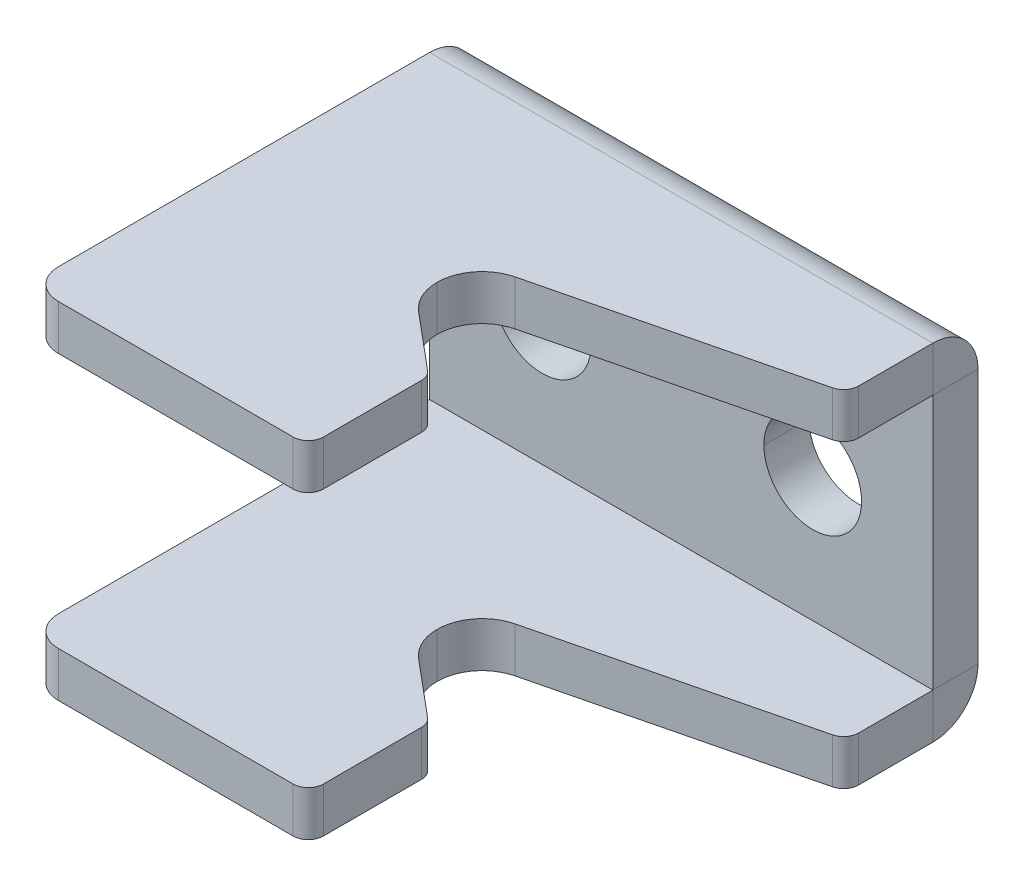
ISO-10303-21;
HEADER;
FILE_DESCRIPTION(('STEP AP214'),'2;1');
FILE_NAME('part.step','',(''),(''),'','','');
FILE_SCHEMA(('AUTOMOTIVE_DESIGN { 1 0 10303 214 1 1 1 1 }'));
ENDSEC;
DATA;
#1=APPLICATION_CONTEXT('core data for automotive mechanical design processes');
#2=APPLICATION_PROTOCOL_DEFINITION('international standard','automotive_design',2000,#1);
#3=PRODUCT_CONTEXT('',#1,'mechanical');
#4=PRODUCT('Part','Part','',(#3));
#5=PRODUCT_RELATED_PRODUCT_CATEGORY('part','',(#4));
#6=PRODUCT_DEFINITION_FORMATION('','',#4);
#7=PRODUCT_DEFINITION_CONTEXT('part definition',#1,'design');
#8=PRODUCT_DEFINITION('design','',#6,#7);
#9=PRODUCT_DEFINITION_SHAPE('','',#8);
#10=(LENGTH_UNIT() NAMED_UNIT(*) SI_UNIT(.MILLI.,.METRE.));
#11=(NAMED_UNIT(*) PLANE_ANGLE_UNIT() SI_UNIT($,.RADIAN.));
#12=(NAMED_UNIT(*) SI_UNIT($,.STERADIAN.) SOLID_ANGLE_UNIT());
#13=UNCERTAINTY_MEASURE_WITH_UNIT(LENGTH_MEASURE(1.E-05),#10,'distance_accuracy_value','');
#14=(GEOMETRIC_REPRESENTATION_CONTEXT(3) GLOBAL_UNCERTAINTY_ASSIGNED_CONTEXT((#13)) GLOBAL_UNIT_ASSIGNED_CONTEXT((#10,
#11,#12)) REPRESENTATION_CONTEXT('',''));
#15=CARTESIAN_POINT('',(0.,0.,0.));
#16=DIRECTION('',(0.,0.,1.));
#17=DIRECTION('',(1.,0.,0.));
#18=AXIS2_PLACEMENT_3D('',#15,#16,#17);
#19=CARTESIAN_POINT('',(0.,0.,3.));
#20=DIRECTION('',(0.,0.,1.));
#21=DIRECTION('',(1.,0.,0.));
#22=AXIS2_PLACEMENT_3D('',#19,#20,#21);
#23=CYLINDRICAL_SURFACE('',#22,3.25);
#24=CARTESIAN_POINT('',(0.,0.,0.));
#25=DIRECTION('',(0.,0.,1.));
#26=DIRECTION('',(1.,0.,0.));
#27=AXIS2_PLACEMENT_3D('',#24,#25,#26);
#28=CIRCLE('',#27,3.25);
#29=CARTESIAN_POINT('',(-3.25,0.,0.));
#30=VERTEX_POINT('',#29);
#31=CARTESIAN_POINT('',(3.25,0.,0.));
#32=VERTEX_POINT('',#31);
#33=EDGE_CURVE('E39',#30,#32,#28,.T.);
#34=ORIENTED_EDGE('',*,*,#33,.F.);
#35=DIRECTION('',(0.,0.,1.));
#36=VECTOR('',#35,1.);
#37=CARTESIAN_POINT('',(-3.25,0.,3.));
#38=LINE('',#37,#36);
#39=CARTESIAN_POINT('',(-3.25,0.,3.));
#40=VERTEX_POINT('',#39);
#41=EDGE_CURVE('E9',#30,#40,#38,.T.);
#42=ORIENTED_EDGE('',*,*,#41,.T.);
#43=CARTESIAN_POINT('',(0.,0.,3.));
#44=DIRECTION('',(0.,0.,1.));
#45=DIRECTION('',(1.,0.,0.));
#46=AXIS2_PLACEMENT_3D('',#43,#44,#45);
#47=CIRCLE('',#46,3.25);
#48=CARTESIAN_POINT('',(3.25,0.,3.));
#49=VERTEX_POINT('',#48);
#50=EDGE_CURVE('E25',#40,#49,#47,.T.);
#51=ORIENTED_EDGE('',*,*,#50,.T.);
#52=DIRECTION('',(0.,0.,1.));
#53=VECTOR('',#52,1.);
#54=CARTESIAN_POINT('',(3.25,0.,3.));
#55=LINE('',#54,#53);
#56=EDGE_CURVE('E356',#32,#49,#55,.T.);
#57=ORIENTED_EDGE('',*,*,#56,.F.);
#58=EDGE_LOOP('',(#34,#42,#51,#57));
#59=FACE_BOUND('',#58,.T.);
#60=ADVANCED_FACE('F14',(#59),#23,.F.);
#61=CARTESIAN_POINT('',(18.,0.,3.));
#62=DIRECTION('',(0.,0.,1.));
#63=DIRECTION('',(1.,0.,0.));
#64=AXIS2_PLACEMENT_3D('',#61,#62,#63);
#65=CYLINDRICAL_SURFACE('',#64,3.25);
#66=CARTESIAN_POINT('',(18.,0.,0.));
#67=DIRECTION('',(0.,0.,1.));
#68=DIRECTION('',(1.,0.,0.));
#69=AXIS2_PLACEMENT_3D('',#66,#67,#68);
#70=CIRCLE('',#69,3.25);
#71=CARTESIAN_POINT('',(14.75,0.,0.));
#72=VERTEX_POINT('',#71);
#73=CARTESIAN_POINT('',(21.25,0.,0.));
#74=VERTEX_POINT('',#73);
#75=EDGE_CURVE('E454',#72,#74,#70,.T.);
#76=ORIENTED_EDGE('',*,*,#75,.F.);
#77=DIRECTION('',(0.,0.,1.));
#78=VECTOR('',#77,1.);
#79=CARTESIAN_POINT('',(14.75,0.,3.));
#80=LINE('',#79,#78);
#81=CARTESIAN_POINT('',(14.75,0.,3.));
#82=VERTEX_POINT('',#81);
#83=EDGE_CURVE('E554',#72,#82,#80,.T.);
#84=ORIENTED_EDGE('',*,*,#83,.T.);
#85=CARTESIAN_POINT('',(18.,0.,3.));
#86=DIRECTION('',(0.,0.,1.));
#87=DIRECTION('',(1.,0.,0.));
#88=AXIS2_PLACEMENT_3D('',#85,#86,#87);
#89=CIRCLE('',#88,3.25);
#90=CARTESIAN_POINT('',(21.25,0.,3.));
#91=VERTEX_POINT('',#90);
#92=EDGE_CURVE('E641',#82,#91,#89,.T.);
#93=ORIENTED_EDGE('',*,*,#92,.T.);
#94=DIRECTION('',(0.,0.,1.));
#95=VECTOR('',#94,1.);
#96=CARTESIAN_POINT('',(21.25,0.,3.));
#97=LINE('',#96,#95);
#98=EDGE_CURVE('E348',#74,#91,#97,.T.);
#99=ORIENTED_EDGE('',*,*,#98,.F.);
#100=EDGE_LOOP('',(#76,#84,#93,#99));
#101=FACE_BOUND('',#100,.T.);
#102=ADVANCED_FACE('F783',(#101),#65,.F.);
#103=CARTESIAN_POINT('',(9.,8.49999999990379,15.9999999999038));
#104=DIRECTION('',(0.,1.,0.));
#105=DIRECTION('',(-1.,0.,0.));
#106=AXIS2_PLACEMENT_3D('',#103,#104,#105);
#107=CYLINDRICAL_SURFACE('',#106,3.);
#108=CARTESIAN_POINT('',(9.,8.49999999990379,15.9999999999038));
#109=DIRECTION('',(0.,1.,0.));
#110=DIRECTION('',(1.,0.,0.));
#111=AXIS2_PLACEMENT_3D('',#108,#109,#110);
#112=CIRCLE('',#111,3.);
#113=CARTESIAN_POINT('',(6.,8.49999999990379,15.9999999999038));
#114=VERTEX_POINT('',#113);
#115=CARTESIAN_POINT('',(7.07280249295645,8.49999999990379,18.2991106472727));
#116=VERTEX_POINT('',#115);
#117=EDGE_CURVE('E440',#114,#116,#112,.T.);
#118=ORIENTED_EDGE('',*,*,#117,.F.);
#119=DIRECTION('',(0.,1.,0.));
#120=VECTOR('',#119,1.);
#121=CARTESIAN_POINT('',(6.,8.49999999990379,15.9999999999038));
#122=LINE('',#121,#120);
#123=CARTESIAN_POINT('',(6.,11.4999999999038,15.9999999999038));
#124=VERTEX_POINT('',#123);
#125=EDGE_CURVE('E542',#114,#124,#122,.T.);
#126=ORIENTED_EDGE('',*,*,#125,.T.);
#127=CARTESIAN_POINT('',(9.,11.4999999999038,15.9999999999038));
#128=DIRECTION('',(0.,1.,0.));
#129=DIRECTION('',(1.,0.,0.));
#130=AXIS2_PLACEMENT_3D('',#127,#128,#129);
#131=CIRCLE('',#130,3.);
#132=CARTESIAN_POINT('',(7.0728024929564,11.4999999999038,18.2991106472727));
#133=VERTEX_POINT('',#132);
#134=EDGE_CURVE('E423',#124,#133,#131,.T.);
#135=ORIENTED_EDGE('',*,*,#134,.T.);
#136=DIRECTION('',(0.,1.,0.));
#137=VECTOR('',#136,1.);
#138=CARTESIAN_POINT('',(7.07280249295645,8.49999999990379,18.2991106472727));
#139=LINE('',#138,#137);
#140=EDGE_CURVE('E415',#116,#133,#139,.T.);
#141=ORIENTED_EDGE('',*,*,#140,.F.);
#142=EDGE_LOOP('',(#118,#126,#135,#141));
#143=FACE_BOUND('',#142,.T.);
#144=ADVANCED_FACE('F789',(#143),#107,.F.);
#145=CARTESIAN_POINT('',(9.,-8.49999999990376,15.9999999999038));
#146=DIRECTION('',(0.,-1.,0.));
#147=DIRECTION('',(-1.,0.,0.));
#148=AXIS2_PLACEMENT_3D('',#145,#146,#147);
#149=CYLINDRICAL_SURFACE('',#148,3.);
#150=CARTESIAN_POINT('',(9.,-8.49999999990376,15.9999999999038));
#151=DIRECTION('',(0.,-1.,0.));
#152=DIRECTION('',(1.,0.,0.));
#153=AXIS2_PLACEMENT_3D('',#150,#151,#152);
#154=CIRCLE('',#153,3.);
#155=CARTESIAN_POINT('',(6.,-8.49999999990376,15.9999999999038));
#156=VERTEX_POINT('',#155);
#157=CARTESIAN_POINT('',(8.2834036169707,-8.49999999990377,13.0868419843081));
#158=VERTEX_POINT('',#157);
#159=EDGE_CURVE('E366',#156,#158,#154,.T.);
#160=ORIENTED_EDGE('',*,*,#159,.F.);
#161=DIRECTION('',(0.,-1.,0.));
#162=VECTOR('',#161,1.);
#163=CARTESIAN_POINT('',(6.,-8.49999999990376,15.9999999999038));
#164=LINE('',#163,#162);
#165=CARTESIAN_POINT('',(6.,-11.4999999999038,15.9999999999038));
#166=VERTEX_POINT('',#165);
#167=EDGE_CURVE('E354',#156,#166,#164,.T.);
#168=ORIENTED_EDGE('',*,*,#167,.T.);
#169=CARTESIAN_POINT('',(9.,-11.4999999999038,15.9999999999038));
#170=DIRECTION('',(0.,-1.,0.));
#171=DIRECTION('',(1.,0.,0.));
#172=AXIS2_PLACEMENT_3D('',#169,#170,#171);
#173=CIRCLE('',#172,3.);
#174=CARTESIAN_POINT('',(8.2834036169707,-11.4999999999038,13.0868419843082));
#175=VERTEX_POINT('',#174);
#176=EDGE_CURVE('E350',#166,#175,#173,.T.);
#177=ORIENTED_EDGE('',*,*,#176,.T.);
#178=DIRECTION('',(0.,-1.,0.));
#179=VECTOR('',#178,1.);
#180=CARTESIAN_POINT('',(8.2834036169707,-8.49999999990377,13.0868419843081));
#181=LINE('',#180,#179);
#182=EDGE_CURVE('E391',#158,#175,#181,.T.);
#183=ORIENTED_EDGE('',*,*,#182,.F.);
#184=EDGE_LOOP('',(#160,#168,#177,#183));
#185=FACE_BOUND('',#184,.T.);
#186=ADVANCED_FACE('F762',(#185),#149,.F.);
#187=CARTESIAN_POINT('',(9.,-23.85619449,3.));
#188=DIRECTION('',(0.,0.,1.));
#189=DIRECTION('',(0.,1.,0.));
#190=AXIS2_PLACEMENT_3D('',#187,#188,#189);
#191=PLANE('',#190);
#192=DIRECTION('',(0.,1.,0.));
#193=VECTOR('',#192,1.);
#194=CARTESIAN_POINT('',(26.,15.8011758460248,3.));
#195=LINE('',#194,#193);
#196=CARTESIAN_POINT('',(26.,-8.49999999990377,3.));
#197=VERTEX_POINT('',#196);
#198=CARTESIAN_POINT('',(26.,8.49999999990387,3.));
#199=VERTEX_POINT('',#198);
#200=EDGE_CURVE('E355',#197,#199,#195,.T.);
#201=ORIENTED_EDGE('',*,*,#200,.T.);
#202=DIRECTION('',(-1.,0.,0.));
#203=VECTOR('',#202,1.);
#204=CARTESIAN_POINT('',(9.,8.49999999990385,3.));
#205=LINE('',#204,#203);
#206=CARTESIAN_POINT('',(-7.5,8.49999999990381,3.));
#207=VERTEX_POINT('',#206);
#208=EDGE_CURVE('E398',#199,#207,#205,.T.);
#209=ORIENTED_EDGE('',*,*,#208,.T.);
#210=DIRECTION('',(0.,-1.,0.));
#211=VECTOR('',#210,1.);
#212=CARTESIAN_POINT('',(-7.5,-35.55619449,3.));
#213=LINE('',#212,#211);
#214=CARTESIAN_POINT('',(-7.5,-8.49999999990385,3.));
#215=VERTEX_POINT('',#214);
#216=EDGE_CURVE('E546',#207,#215,#213,.T.);
#217=ORIENTED_EDGE('',*,*,#216,.T.);
#218=DIRECTION('',(-1.,0.,0.));
#219=VECTOR('',#218,1.);
#220=CARTESIAN_POINT('',(9.,-8.4999999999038,3.));
#221=LINE('',#220,#219);
#222=EDGE_CURVE('E651',#197,#215,#221,.T.);
#223=ORIENTED_EDGE('',*,*,#222,.F.);
#224=EDGE_LOOP('',(#201,#209,#217,#223));
#225=FACE_BOUND('',#224,.T.);
#226=CARTESIAN_POINT('',(0.,0.,3.));
#227=DIRECTION('',(0.,0.,1.));
#228=DIRECTION('',(1.,0.,0.));
#229=AXIS2_PLACEMENT_3D('',#226,#227,#228);
#230=CIRCLE('',#229,3.25);
#231=EDGE_CURVE('E359',#49,#40,#230,.T.);
#232=ORIENTED_EDGE('',*,*,#231,.F.);
#233=ORIENTED_EDGE('',*,*,#50,.F.);
#234=EDGE_LOOP('',(#232,#233));
#235=FACE_BOUND('',#234,.T.);
#236=CARTESIAN_POINT('',(18.,0.,3.));
#237=DIRECTION('',(0.,0.,1.));
#238=DIRECTION('',(1.,0.,0.));
#239=AXIS2_PLACEMENT_3D('',#236,#237,#238);
#240=CIRCLE('',#239,3.25);
#241=EDGE_CURVE('E358',#91,#82,#240,.T.);
#242=ORIENTED_EDGE('',*,*,#241,.F.);
#243=ORIENTED_EDGE('',*,*,#92,.F.);
#244=EDGE_LOOP('',(#242,#243));
#245=FACE_BOUND('',#244,.T.);
#246=ADVANCED_FACE('F729',(#225,#235,#245),#191,.T.);
#247=CARTESIAN_POINT('',(9.,-23.85619449,0.));
#248=DIRECTION('',(0.,0.,1.));
#249=DIRECTION('',(0.,1.,0.));
#250=AXIS2_PLACEMENT_3D('',#247,#248,#249);
#251=PLANE('',#250);
#252=DIRECTION('',(-1.,0.,0.));
#253=VECTOR('',#252,1.);
#254=CARTESIAN_POINT('',(9.,8.49999999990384,0.));
#255=LINE('',#254,#253);
#256=CARTESIAN_POINT('',(26.,8.49999999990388,0.));
#257=VERTEX_POINT('',#256);
#258=CARTESIAN_POINT('',(-7.5,8.49999999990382,0.));
#259=VERTEX_POINT('',#258);
#260=EDGE_CURVE('E311',#257,#259,#255,.T.);
#261=ORIENTED_EDGE('',*,*,#260,.F.);
#262=DIRECTION('',(0.,1.,0.));
#263=VECTOR('',#262,1.);
#264=CARTESIAN_POINT('',(26.,15.8011758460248,0.));
#265=LINE('',#264,#263);
#266=CARTESIAN_POINT('',(26.,-8.49999999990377,0.));
#267=VERTEX_POINT('',#266);
#268=EDGE_CURVE('E424',#267,#257,#265,.T.);
#269=ORIENTED_EDGE('',*,*,#268,.F.);
#270=DIRECTION('',(-1.,0.,0.));
#271=VECTOR('',#270,1.);
#272=CARTESIAN_POINT('',(9.,-8.4999999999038,0.));
#273=LINE('',#272,#271);
#274=CARTESIAN_POINT('',(-7.5,-8.49999999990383,0.));
#275=VERTEX_POINT('',#274);
#276=EDGE_CURVE('E434',#267,#275,#273,.T.);
#277=ORIENTED_EDGE('',*,*,#276,.T.);
#278=DIRECTION('',(0.,-1.,0.));
#279=VECTOR('',#278,1.);
#280=CARTESIAN_POINT('',(-7.5,-35.55619449,0.));
#281=LINE('',#280,#279);
#282=EDGE_CURVE('E450',#259,#275,#281,.T.);
#283=ORIENTED_EDGE('',*,*,#282,.F.);
#284=EDGE_LOOP('',(#261,#269,#277,#283));
#285=FACE_BOUND('',#284,.T.);
#286=CARTESIAN_POINT('',(0.,0.,0.));
#287=DIRECTION('',(0.,0.,1.));
#288=DIRECTION('',(1.,0.,0.));
#289=AXIS2_PLACEMENT_3D('',#286,#287,#288);
#290=CIRCLE('',#289,3.25);
#291=EDGE_CURVE('E430',#32,#30,#290,.T.);
#292=ORIENTED_EDGE('',*,*,#291,.T.);
#293=ORIENTED_EDGE('',*,*,#33,.T.);
#294=EDGE_LOOP('',(#292,#293));
#295=FACE_BOUND('',#294,.T.);
#296=CARTESIAN_POINT('',(18.,0.,0.));
#297=DIRECTION('',(0.,0.,1.));
#298=DIRECTION('',(1.,0.,0.));
#299=AXIS2_PLACEMENT_3D('',#296,#297,#298);
#300=CIRCLE('',#299,3.25);
#301=EDGE_CURVE('E595',#74,#72,#300,.T.);
#302=ORIENTED_EDGE('',*,*,#301,.T.);
#303=ORIENTED_EDGE('',*,*,#75,.T.);
#304=EDGE_LOOP('',(#302,#303));
#305=FACE_BOUND('',#304,.T.);
#306=ADVANCED_FACE('F814',(#285,#295,#305),#251,.F.);
#307=CARTESIAN_POINT('',(-7.5,-35.55619449,3.));
#308=DIRECTION('',(1.,0.,0.));
#309=DIRECTION('',(0.,1.,0.));
#310=AXIS2_PLACEMENT_3D('',#307,#308,#309);
#311=PLANE('',#310);
#312=DIRECTION('',(0.,0.,1.));
#313=VECTOR('',#312,1.);
#314=CARTESIAN_POINT('',(-7.5,8.49999999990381,3.));
#315=LINE('',#314,#313);
#316=EDGE_CURVE('E286',#259,#207,#315,.T.);
#317=ORIENTED_EDGE('',*,*,#316,.F.);
#318=ORIENTED_EDGE('',*,*,#282,.T.);
#319=DIRECTION('',(0.,0.,1.));
#320=VECTOR('',#319,1.);
#321=CARTESIAN_POINT('',(-7.5,-8.49999999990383,3.));
#322=LINE('',#321,#320);
#323=EDGE_CURVE('E455',#275,#215,#322,.T.);
#324=ORIENTED_EDGE('',*,*,#323,.T.);
#325=ORIENTED_EDGE('',*,*,#216,.F.);
#326=EDGE_LOOP('',(#317,#318,#324,#325));
#327=FACE_BOUND('',#326,.T.);
#328=ADVANCED_FACE('F725',(#327),#311,.F.);
#329=CARTESIAN_POINT('',(26.,15.8011758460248,3.));
#330=DIRECTION('',(-1.,0.,0.));
#331=DIRECTION('',(0.,-1.,0.));
#332=AXIS2_PLACEMENT_3D('',#329,#330,#331);
#333=PLANE('',#332);
#334=DIRECTION('',(0.,0.,-1.));
#335=VECTOR('',#334,1.);
#336=CARTESIAN_POINT('',(26.,8.49999999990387,3.));
#337=LINE('',#336,#335);
#338=EDGE_CURVE('E605',#199,#257,#337,.T.);
#339=ORIENTED_EDGE('',*,*,#338,.F.);
#340=ORIENTED_EDGE('',*,*,#200,.F.);
#341=DIRECTION('',(0.,0.,-1.));
#342=VECTOR('',#341,1.);
#343=CARTESIAN_POINT('',(26.,-8.49999999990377,3.));
#344=LINE('',#343,#342);
#345=EDGE_CURVE('E428',#197,#267,#344,.T.);
#346=ORIENTED_EDGE('',*,*,#345,.T.);
#347=ORIENTED_EDGE('',*,*,#268,.T.);
#348=EDGE_LOOP('',(#339,#340,#346,#347));
#349=FACE_BOUND('',#348,.T.);
#350=ADVANCED_FACE('F813',(#349),#333,.F.);
#351=CARTESIAN_POINT('',(-7.5,-8.49999999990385,3.));
#352=DIRECTION('',(-1.,0.,0.));
#353=DIRECTION('',(0.,0.,-1.));
#354=AXIS2_PLACEMENT_3D('',#351,#352,#353);
#355=PLANE('',#354);
#356=CARTESIAN_POINT('',(-7.5,-8.49999999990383,3.));
#357=DIRECTION('',(1.,0.,0.));
#358=DIRECTION('',(0.,1.,0.));
#359=AXIS2_PLACEMENT_3D('',#356,#357,#358);
#360=CIRCLE('',#359,3.);
#361=CARTESIAN_POINT('',(-7.5,-11.4999999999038,3.));
#362=VERTEX_POINT('',#361);
#363=EDGE_CURVE('E538',#362,#275,#360,.T.);
#364=ORIENTED_EDGE('',*,*,#363,.F.);
#365=DIRECTION('',(0.,1.,0.));
#366=VECTOR('',#365,1.);
#367=CARTESIAN_POINT('',(-7.5,-8.49999999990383,3.));
#368=LINE('',#367,#366);
#369=EDGE_CURVE('E429',#362,#215,#368,.T.);
#370=ORIENTED_EDGE('',*,*,#369,.T.);
#371=ORIENTED_EDGE('',*,*,#323,.F.);
#372=EDGE_LOOP('',(#364,#370,#371));
#373=FACE_BOUND('',#372,.T.);
#374=ADVANCED_FACE('F741',(#373),#355,.T.);
#375=CARTESIAN_POINT('',(26.,-8.49999999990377,3.));
#376=DIRECTION('',(1.,0.,0.));
#377=DIRECTION('',(0.,1.,0.));
#378=AXIS2_PLACEMENT_3D('',#375,#376,#377);
#379=CYLINDRICAL_SURFACE('',#378,3.);
#380=CARTESIAN_POINT('',(26.,-8.49999999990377,3.));
#381=DIRECTION('',(1.,0.,0.));
#382=DIRECTION('',(0.,1.,0.));
#383=AXIS2_PLACEMENT_3D('',#380,#381,#382);
#384=CIRCLE('',#383,3.);
#385=CARTESIAN_POINT('',(26.,-11.4999999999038,3.));
#386=VERTEX_POINT('',#385);
#387=EDGE_CURVE('E518',#386,#267,#384,.T.);
#388=ORIENTED_EDGE('',*,*,#387,.F.);
#389=DIRECTION('',(-1.,0.,0.));
#390=VECTOR('',#389,1.);
#391=CARTESIAN_POINT('',(9.,-11.4999999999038,3.));
#392=LINE('',#391,#390);
#393=EDGE_CURVE('E534',#386,#362,#392,.T.);
#394=ORIENTED_EDGE('',*,*,#393,.T.);
#395=ORIENTED_EDGE('',*,*,#363,.T.);
#396=ORIENTED_EDGE('',*,*,#276,.F.);
#397=EDGE_LOOP('',(#388,#394,#395,#396));
#398=FACE_BOUND('',#397,.T.);
#399=ADVANCED_FACE('F745',(#398),#379,.T.);
#400=CARTESIAN_POINT('',(26.,-8.49999999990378,3.));
#401=DIRECTION('',(1.,0.,0.));
#402=DIRECTION('',(0.,1.,0.));
#403=AXIS2_PLACEMENT_3D('',#400,#401,#402);
#404=PLANE('',#403);
#405=DIRECTION('',(0.,-1.,0.));
#406=VECTOR('',#405,1.);
#407=CARTESIAN_POINT('',(26.,-8.49999999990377,3.));
#408=LINE('',#407,#406);
#409=EDGE_CURVE('E618',#197,#386,#408,.T.);
#410=ORIENTED_EDGE('',*,*,#409,.T.);
#411=ORIENTED_EDGE('',*,*,#387,.T.);
#412=ORIENTED_EDGE('',*,*,#345,.F.);
#413=EDGE_LOOP('',(#410,#411,#412));
#414=FACE_BOUND('',#413,.T.);
#415=ADVANCED_FACE('F793',(#414),#404,.T.);
#416=CARTESIAN_POINT('',(25.,-8.49999999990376,7.94498135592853));
#417=DIRECTION('',(0.,-1.,0.));
#418=DIRECTION('',(-1.,0.,0.));
#419=AXIS2_PLACEMENT_3D('',#416,#417,#418);
#420=CYLINDRICAL_SURFACE('',#419,1.);
#421=CARTESIAN_POINT('',(25.,-11.4999999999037,7.94498135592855));
#422=DIRECTION('',(0.,1.,0.));
#423=DIRECTION('',(1.,0.,0.));
#424=AXIS2_PLACEMENT_3D('',#421,#422,#423);
#425=CIRCLE('',#424,1.);
#426=CARTESIAN_POINT('',(25.2388654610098,-11.4999999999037,8.91603402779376));
#427=VERTEX_POINT('',#426);
#428=CARTESIAN_POINT('',(26.,-11.4999999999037,7.94498135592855));
#429=VERTEX_POINT('',#428);
#430=EDGE_CURVE('E374',#427,#429,#425,.T.);
#431=ORIENTED_EDGE('',*,*,#430,.T.);
#432=DIRECTION('',(0.,-1.,0.));
#433=VECTOR('',#432,1.);
#434=CARTESIAN_POINT('',(26.,-8.49999999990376,7.94498135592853));
#435=LINE('',#434,#433);
#436=CARTESIAN_POINT('',(26.,-8.49999999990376,7.94498135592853));
#437=VERTEX_POINT('',#436);
#438=EDGE_CURVE('E333',#437,#429,#435,.T.);
#439=ORIENTED_EDGE('',*,*,#438,.F.);
#440=CARTESIAN_POINT('',(25.,-8.49999999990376,7.94498135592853));
#441=DIRECTION('',(0.,1.,0.));
#442=DIRECTION('',(1.,0.,0.));
#443=AXIS2_PLACEMENT_3D('',#440,#441,#442);
#444=CIRCLE('',#443,1.);
#445=CARTESIAN_POINT('',(25.2388654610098,-8.49999999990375,8.91603402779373));
#446=VERTEX_POINT('',#445);
#447=EDGE_CURVE('E522',#446,#437,#444,.T.);
#448=ORIENTED_EDGE('',*,*,#447,.F.);
#449=DIRECTION('',(0.,-1.,0.));
#450=VECTOR('',#449,1.);
#451=CARTESIAN_POINT('',(25.2388654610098,-8.49999999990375,8.91603402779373));
#452=LINE('',#451,#450);
#453=EDGE_CURVE('E371',#446,#427,#452,.T.);
#454=ORIENTED_EDGE('',*,*,#453,.T.);
#455=EDGE_LOOP('',(#431,#439,#448,#454));
#456=FACE_BOUND('',#455,.T.);
#457=ADVANCED_FACE('F755',(#456),#420,.T.);
#458=CARTESIAN_POINT('',(8.2834036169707,-8.49999999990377,13.0868419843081));
#459=DIRECTION('',(-0.238865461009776,0.,-0.971052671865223));
#460=DIRECTION('',(-0.971052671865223,0.,0.238865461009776));
#461=AXIS2_PLACEMENT_3D('',#458,#459,#460);
#462=PLANE('',#461);
#463=DIRECTION('',(0.971052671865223,0.,-0.238865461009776));
#464=VECTOR('',#463,1.);
#465=CARTESIAN_POINT('',(8.2834036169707,-11.4999999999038,13.0868419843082));
#466=LINE('',#465,#464);
#467=EDGE_CURVE('E375',#175,#427,#466,.T.);
#468=ORIENTED_EDGE('',*,*,#467,.T.);
#469=ORIENTED_EDGE('',*,*,#453,.F.);
#470=DIRECTION('',(0.971052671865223,0.,-0.238865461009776));
#471=VECTOR('',#470,1.);
#472=CARTESIAN_POINT('',(8.2834036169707,-8.49999999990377,13.0868419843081));
#473=LINE('',#472,#471);
#474=EDGE_CURVE('E370',#158,#446,#473,.T.);
#475=ORIENTED_EDGE('',*,*,#474,.F.);
#476=ORIENTED_EDGE('',*,*,#182,.T.);
#477=EDGE_LOOP('',(#468,#469,#475,#476));
#478=FACE_BOUND('',#477,.T.);
#479=ADVANCED_FACE('F16',(#478),#462,.F.);
#480=CARTESIAN_POINT('',(9.,-8.49999999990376,15.9999999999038));
#481=DIRECTION('',(0.,-1.,0.));
#482=DIRECTION('',(-1.,0.,0.));
#483=AXIS2_PLACEMENT_3D('',#480,#481,#482);
#484=CYLINDRICAL_SURFACE('',#483,3.);
#485=ORIENTED_EDGE('',*,*,#167,.F.);
#486=CARTESIAN_POINT('',(9.,-8.49999999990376,15.9999999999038));
#487=DIRECTION('',(0.,-1.,0.));
#488=DIRECTION('',(1.,0.,0.));
#489=AXIS2_PLACEMENT_3D('',#486,#487,#488);
#490=CIRCLE('',#489,3.);
#491=CARTESIAN_POINT('',(7.07280249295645,-8.49999999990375,18.2991106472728));
#492=VERTEX_POINT('',#491);
#493=EDGE_CURVE('E369',#492,#156,#490,.T.);
#494=ORIENTED_EDGE('',*,*,#493,.F.);
#495=DIRECTION('',(0.,-1.,0.));
#496=VECTOR('',#495,1.);
#497=CARTESIAN_POINT('',(7.07280249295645,-8.49999999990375,18.2991106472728));
#498=LINE('',#497,#496);
#499=CARTESIAN_POINT('',(7.07280249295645,-11.4999999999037,18.2991106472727));
#500=VERTEX_POINT('',#499);
#501=EDGE_CURVE('E394',#492,#500,#498,.T.);
#502=ORIENTED_EDGE('',*,*,#501,.T.);
#503=CARTESIAN_POINT('',(9.,-11.4999999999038,15.9999999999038));
#504=DIRECTION('',(0.,-1.,0.));
#505=DIRECTION('',(1.,0.,0.));
#506=AXIS2_PLACEMENT_3D('',#503,#504,#505);
#507=CIRCLE('',#506,3.);
#508=EDGE_CURVE('E613',#500,#166,#507,.T.);
#509=ORIENTED_EDGE('',*,*,#508,.T.);
#510=EDGE_LOOP('',(#485,#494,#502,#509));
#511=FACE_BOUND('',#510,.T.);
#512=ADVANCED_FACE('F768',(#511),#484,.F.);
#513=CARTESIAN_POINT('',(10.7723991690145,-8.49999999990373,21.4002460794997));
#514=DIRECTION('',(-0.64239916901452,0.,0.766370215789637));
#515=DIRECTION('',(0.,-1.,0.));
#516=AXIS2_PLACEMENT_3D('',#513,#514,#515);
#517=PLANE('',#516);
#518=DIRECTION('',(-0.766370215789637,0.,-0.64239916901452));
#519=VECTOR('',#518,1.);
#520=CARTESIAN_POINT('',(10.7723991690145,-11.4999999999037,21.4002460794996));
#521=LINE('',#520,#519);
#522=CARTESIAN_POINT('',(10.7723991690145,-11.4999999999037,21.4002460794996));
#523=VERTEX_POINT('',#522);
#524=EDGE_CURVE('E617',#523,#500,#521,.T.);
#525=ORIENTED_EDGE('',*,*,#524,.T.);
#526=ORIENTED_EDGE('',*,*,#501,.F.);
#527=DIRECTION('',(-0.766370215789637,0.,-0.64239916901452));
#528=VECTOR('',#527,1.);
#529=CARTESIAN_POINT('',(10.7723991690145,-8.49999999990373,21.4002460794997));
#530=LINE('',#529,#528);
#531=CARTESIAN_POINT('',(10.7723991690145,-8.49999999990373,21.4002460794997));
#532=VERTEX_POINT('',#531);
#533=EDGE_CURVE('E399',#532,#492,#530,.T.);
#534=ORIENTED_EDGE('',*,*,#533,.F.);
#535=DIRECTION('',(0.,-1.,0.));
#536=VECTOR('',#535,1.);
#537=CARTESIAN_POINT('',(10.7723991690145,-8.49999999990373,21.4002460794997));
#538=LINE('',#537,#536);
#539=EDGE_CURVE('E479',#532,#523,#538,.T.);
#540=ORIENTED_EDGE('',*,*,#539,.T.);
#541=EDGE_LOOP('',(#525,#526,#534,#540));
#542=FACE_BOUND('',#541,.T.);
#543=ADVANCED_FACE('F770',(#542),#517,.F.);
#544=CARTESIAN_POINT('',(10.13,-8.49999999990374,22.1666162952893));
#545=DIRECTION('',(0.,-1.,0.));
#546=DIRECTION('',(-1.,0.,0.));
#547=AXIS2_PLACEMENT_3D('',#544,#545,#546);
#548=CYLINDRICAL_SURFACE('',#547,1.);
#549=CARTESIAN_POINT('',(10.13,-11.4999999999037,22.1666162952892));
#550=DIRECTION('',(0.,1.,0.));
#551=DIRECTION('',(-1.,0.,0.));
#552=AXIS2_PLACEMENT_3D('',#549,#550,#551);
#553=CIRCLE('',#552,1.);
#554=CARTESIAN_POINT('',(11.13,-11.4999999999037,22.1666162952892));
#555=VERTEX_POINT('',#554);
#556=EDGE_CURVE('E487',#555,#523,#553,.T.);
#557=ORIENTED_EDGE('',*,*,#556,.T.);
#558=ORIENTED_EDGE('',*,*,#539,.F.);
#559=CARTESIAN_POINT('',(10.13,-8.49999999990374,22.1666162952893));
#560=DIRECTION('',(0.,1.,0.));
#561=DIRECTION('',(-1.,0.,0.));
#562=AXIS2_PLACEMENT_3D('',#559,#560,#561);
#563=CIRCLE('',#562,1.);
#564=CARTESIAN_POINT('',(11.13,-8.49999999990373,22.1666162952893));
#565=VERTEX_POINT('',#564);
#566=EDGE_CURVE('E403',#565,#532,#563,.T.);
#567=ORIENTED_EDGE('',*,*,#566,.F.);
#568=DIRECTION('',(0.,-1.,0.));
#569=VECTOR('',#568,1.);
#570=CARTESIAN_POINT('',(11.13,-8.49999999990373,22.1666162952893));
#571=LINE('',#570,#569);
#572=EDGE_CURVE('E477',#565,#555,#571,.T.);
#573=ORIENTED_EDGE('',*,*,#572,.T.);
#574=EDGE_LOOP('',(#557,#558,#567,#573));
#575=FACE_BOUND('',#574,.T.);
#576=ADVANCED_FACE('F476',(#575),#548,.T.);
#577=CARTESIAN_POINT('',(11.13,-8.4999999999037,28.6999999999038));
#578=DIRECTION('',(-1.,0.,0.));
#579=DIRECTION('',(0.,0.,-1.));
#580=AXIS2_PLACEMENT_3D('',#577,#578,#579);
#581=PLANE('',#580);
#582=DIRECTION('',(0.,0.,-1.));
#583=VECTOR('',#582,1.);
#584=CARTESIAN_POINT('',(11.13,-11.4999999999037,28.6999999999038));
#585=LINE('',#584,#583);
#586=CARTESIAN_POINT('',(11.13,-11.4999999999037,28.6999999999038));
#587=VERTEX_POINT('',#586);
#588=EDGE_CURVE('E485',#587,#555,#585,.T.);
#589=ORIENTED_EDGE('',*,*,#588,.T.);
#590=ORIENTED_EDGE('',*,*,#572,.F.);
#591=DIRECTION('',(0.,0.,-1.));
#592=VECTOR('',#591,1.);
#593=CARTESIAN_POINT('',(11.13,-8.4999999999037,28.6999999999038));
#594=LINE('',#593,#592);
#595=CARTESIAN_POINT('',(11.13,-8.4999999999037,28.6999999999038));
#596=VERTEX_POINT('',#595);
#597=EDGE_CURVE('E404',#596,#565,#594,.T.);
#598=ORIENTED_EDGE('',*,*,#597,.F.);
#599=DIRECTION('',(0.,-1.,0.));
#600=VECTOR('',#599,1.);
#601=CARTESIAN_POINT('',(11.13,-8.4999999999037,28.6999999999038));
#602=LINE('',#601,#600);
#603=EDGE_CURVE('E496',#596,#587,#602,.T.);
#604=ORIENTED_EDGE('',*,*,#603,.T.);
#605=EDGE_LOOP('',(#589,#590,#598,#604));
#606=FACE_BOUND('',#605,.T.);
#607=ADVANCED_FACE('F482',(#606),#581,.F.);
#608=CARTESIAN_POINT('',(10.13,-8.4999999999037,28.6999999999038));
#609=DIRECTION('',(0.,-1.,0.));
#610=DIRECTION('',(-1.,0.,0.));
#611=AXIS2_PLACEMENT_3D('',#608,#609,#610);
#612=CYLINDRICAL_SURFACE('',#611,1.);
#613=CARTESIAN_POINT('',(10.13,-11.4999999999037,28.6999999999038));
#614=DIRECTION('',(0.,1.,0.));
#615=DIRECTION('',(-1.,0.,0.));
#616=AXIS2_PLACEMENT_3D('',#613,#614,#615);
#617=CIRCLE('',#616,1.);
#618=CARTESIAN_POINT('',(10.13,-11.4999999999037,29.6999999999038));
#619=VERTEX_POINT('',#618);
#620=EDGE_CURVE('E346',#619,#587,#617,.T.);
#621=ORIENTED_EDGE('',*,*,#620,.T.);
#622=ORIENTED_EDGE('',*,*,#603,.F.);
#623=CARTESIAN_POINT('',(10.13,-8.4999999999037,28.6999999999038));
#624=DIRECTION('',(0.,1.,0.));
#625=DIRECTION('',(-1.,0.,0.));
#626=AXIS2_PLACEMENT_3D('',#623,#624,#625);
#627=CIRCLE('',#626,1.);
#628=CARTESIAN_POINT('',(10.13,-8.4999999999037,29.6999999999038));
#629=VERTEX_POINT('',#628);
#630=EDGE_CURVE('E408',#629,#596,#627,.T.);
#631=ORIENTED_EDGE('',*,*,#630,.F.);
#632=DIRECTION('',(0.,-1.,0.));
#633=VECTOR('',#632,1.);
#634=CARTESIAN_POINT('',(10.13,-8.4999999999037,29.6999999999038));
#635=LINE('',#634,#633);
#636=EDGE_CURVE('E343',#629,#619,#635,.T.);
#637=ORIENTED_EDGE('',*,*,#636,.T.);
#638=EDGE_LOOP('',(#621,#622,#631,#637));
#639=FACE_BOUND('',#638,.T.);
#640=ADVANCED_FACE('F836',(#639),#612,.T.);
#641=CARTESIAN_POINT('',(-5.5,-8.49999999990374,29.6999999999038));
#642=DIRECTION('',(0.,0.,-1.));
#643=DIRECTION('',(0.,-1.,0.));
#644=AXIS2_PLACEMENT_3D('',#641,#642,#643);
#645=PLANE('',#644);
#646=DIRECTION('',(1.,0.,0.));
#647=VECTOR('',#646,1.);
#648=CARTESIAN_POINT('',(-5.5,-11.4999999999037,29.6999999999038));
#649=LINE('',#648,#647);
#650=CARTESIAN_POINT('',(-5.5,-11.4999999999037,29.6999999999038));
#651=VERTEX_POINT('',#650);
#652=EDGE_CURVE('E341',#651,#619,#649,.T.);
#653=ORIENTED_EDGE('',*,*,#652,.T.);
#654=ORIENTED_EDGE('',*,*,#636,.F.);
#655=DIRECTION('',(1.,0.,0.));
#656=VECTOR('',#655,1.);
#657=CARTESIAN_POINT('',(-5.5,-8.49999999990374,29.6999999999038));
#658=LINE('',#657,#656);
#659=CARTESIAN_POINT('',(-5.5,-8.49999999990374,29.6999999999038));
#660=VERTEX_POINT('',#659);
#661=EDGE_CURVE('E445',#660,#629,#658,.T.);
#662=ORIENTED_EDGE('',*,*,#661,.F.);
#663=DIRECTION('',(0.,-1.,0.));
#664=VECTOR('',#663,1.);
#665=CARTESIAN_POINT('',(-5.5,-8.49999999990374,29.6999999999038));
#666=LINE('',#665,#664);
#667=EDGE_CURVE('E338',#660,#651,#666,.T.);
#668=ORIENTED_EDGE('',*,*,#667,.T.);
#669=EDGE_LOOP('',(#653,#654,#662,#668));
#670=FACE_BOUND('',#669,.T.);
#671=ADVANCED_FACE('F833',(#670),#645,.F.);
#672=CARTESIAN_POINT('',(-5.5,-8.49999999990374,27.6999999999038));
#673=DIRECTION('',(0.,-1.,0.));
#674=DIRECTION('',(-1.,0.,0.));
#675=AXIS2_PLACEMENT_3D('',#672,#673,#674);
#676=CYLINDRICAL_SURFACE('',#675,2.);
#677=CARTESIAN_POINT('',(-5.5,-11.4999999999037,27.6999999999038));
#678=DIRECTION('',(0.,1.,0.));
#679=DIRECTION('',(-1.,0.,0.));
#680=AXIS2_PLACEMENT_3D('',#677,#678,#679);
#681=CIRCLE('',#680,2.);
#682=CARTESIAN_POINT('',(-7.5,-11.4999999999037,27.6999999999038));
#683=VERTEX_POINT('',#682);
#684=EDGE_CURVE('E342',#683,#651,#681,.T.);
#685=ORIENTED_EDGE('',*,*,#684,.T.);
#686=ORIENTED_EDGE('',*,*,#667,.F.);
#687=CARTESIAN_POINT('',(-5.5,-8.49999999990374,27.6999999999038));
#688=DIRECTION('',(0.,1.,0.));
#689=DIRECTION('',(-1.,0.,0.));
#690=AXIS2_PLACEMENT_3D('',#687,#688,#689);
#691=CIRCLE('',#690,2.);
#692=CARTESIAN_POINT('',(-7.5,-8.49999999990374,27.6999999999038));
#693=VERTEX_POINT('',#692);
#694=EDGE_CURVE('E449',#693,#660,#691,.T.);
#695=ORIENTED_EDGE('',*,*,#694,.F.);
#696=DIRECTION('',(0.,-1.,0.));
#697=VECTOR('',#696,1.);
#698=CARTESIAN_POINT('',(-7.5,-8.49999999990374,27.6999999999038));
#699=LINE('',#698,#697);
#700=EDGE_CURVE('E441',#693,#683,#699,.T.);
#701=ORIENTED_EDGE('',*,*,#700,.T.);
#702=EDGE_LOOP('',(#685,#686,#695,#701));
#703=FACE_BOUND('',#702,.T.);
#704=ADVANCED_FACE('F803',(#703),#676,.T.);
#705=CARTESIAN_POINT('',(9.,-8.49999999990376,15.9999999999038));
#706=DIRECTION('',(0.,1.,0.));
#707=DIRECTION('',(1.,0.,0.));
#708=AXIS2_PLACEMENT_3D('',#705,#706,#707);
#709=PLANE('',#708);
#710=DIRECTION('',(0.,0.,-1.));
#711=VECTOR('',#710,1.);
#712=CARTESIAN_POINT('',(26.,-8.49999999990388,-23.6573703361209));
#713=LINE('',#712,#711);
#714=EDGE_CURVE('E444',#437,#197,#713,.T.);
#715=ORIENTED_EDGE('',*,*,#714,.T.);
#716=ORIENTED_EDGE('',*,*,#222,.T.);
#717=DIRECTION('',(0.,0.,1.));
#718=VECTOR('',#717,1.);
#719=CARTESIAN_POINT('',(-7.5,-8.49999999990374,27.6999999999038));
#720=LINE('',#719,#718);
#721=EDGE_CURVE('E612',#215,#693,#720,.T.);
#722=ORIENTED_EDGE('',*,*,#721,.T.);
#723=ORIENTED_EDGE('',*,*,#694,.T.);
#724=ORIENTED_EDGE('',*,*,#661,.T.);
#725=ORIENTED_EDGE('',*,*,#630,.T.);
#726=ORIENTED_EDGE('',*,*,#597,.T.);
#727=ORIENTED_EDGE('',*,*,#566,.T.);
#728=ORIENTED_EDGE('',*,*,#533,.T.);
#729=ORIENTED_EDGE('',*,*,#493,.T.);
#730=ORIENTED_EDGE('',*,*,#159,.T.);
#731=ORIENTED_EDGE('',*,*,#474,.T.);
#732=ORIENTED_EDGE('',*,*,#447,.T.);
#733=EDGE_LOOP('',(#715,#716,#722,#723,#724,#725,#726,#727,#728,#729,#730,#731,#732));
#734=FACE_BOUND('',#733,.T.);
#735=ADVANCED_FACE('F469',(#734),#709,.T.);
#736=CARTESIAN_POINT('',(-7.5,-8.49999999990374,27.6999999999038));
#737=DIRECTION('',(1.,0.,0.));
#738=DIRECTION('',(0.,1.,0.));
#739=AXIS2_PLACEMENT_3D('',#736,#737,#738);
#740=PLANE('',#739);
#741=ORIENTED_EDGE('',*,*,#369,.F.);
#742=DIRECTION('',(0.,0.,1.));
#743=VECTOR('',#742,1.);
#744=CARTESIAN_POINT('',(-7.5,-11.4999999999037,27.6999999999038));
#745=LINE('',#744,#743);
#746=EDGE_CURVE('E336',#362,#683,#745,.T.);
#747=ORIENTED_EDGE('',*,*,#746,.T.);
#748=ORIENTED_EDGE('',*,*,#700,.F.);
#749=ORIENTED_EDGE('',*,*,#721,.F.);
#750=EDGE_LOOP('',(#741,#747,#748,#749));
#751=FACE_BOUND('',#750,.T.);
#752=ADVANCED_FACE('F737',(#751),#740,.F.);
#753=CARTESIAN_POINT('',(9.,-11.4999999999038,15.9999999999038));
#754=DIRECTION('',(0.,1.,0.));
#755=DIRECTION('',(1.,0.,0.));
#756=AXIS2_PLACEMENT_3D('',#753,#754,#755);
#757=PLANE('',#756);
#758=ORIENTED_EDGE('',*,*,#393,.F.);
#759=DIRECTION('',(0.,0.,-1.));
#760=VECTOR('',#759,1.);
#761=CARTESIAN_POINT('',(26.,-11.4999999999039,-23.6573703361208));
#762=LINE('',#761,#760);
#763=EDGE_CURVE('E337',#429,#386,#762,.T.);
#764=ORIENTED_EDGE('',*,*,#763,.F.);
#765=ORIENTED_EDGE('',*,*,#430,.F.);
#766=ORIENTED_EDGE('',*,*,#467,.F.);
#767=ORIENTED_EDGE('',*,*,#176,.F.);
#768=ORIENTED_EDGE('',*,*,#508,.F.);
#769=ORIENTED_EDGE('',*,*,#524,.F.);
#770=ORIENTED_EDGE('',*,*,#556,.F.);
#771=ORIENTED_EDGE('',*,*,#588,.F.);
#772=ORIENTED_EDGE('',*,*,#620,.F.);
#773=ORIENTED_EDGE('',*,*,#652,.F.);
#774=ORIENTED_EDGE('',*,*,#684,.F.);
#775=ORIENTED_EDGE('',*,*,#746,.F.);
#776=EDGE_LOOP('',(#758,#764,#765,#766,#767,#768,#769,#770,#771,#772,#773,#774,#775));
#777=FACE_BOUND('',#776,.T.);
#778=ADVANCED_FACE('F748',(#777),#757,.F.);
#779=CARTESIAN_POINT('',(26.,-8.49999999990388,-23.6573703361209));
#780=DIRECTION('',(-1.,0.,0.));
#781=DIRECTION('',(0.,-1.,0.));
#782=AXIS2_PLACEMENT_3D('',#779,#780,#781);
#783=PLANE('',#782);
#784=ORIENTED_EDGE('',*,*,#409,.F.);
#785=ORIENTED_EDGE('',*,*,#714,.F.);
#786=ORIENTED_EDGE('',*,*,#438,.T.);
#787=ORIENTED_EDGE('',*,*,#763,.T.);
#788=EDGE_LOOP('',(#784,#785,#786,#787));
#789=FACE_BOUND('',#788,.T.);
#790=ADVANCED_FACE('F752',(#789),#783,.F.);
#791=CARTESIAN_POINT('',(26.,8.49999999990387,3.));
#792=DIRECTION('',(-1.,0.,0.));
#793=DIRECTION('',(0.,0.,-1.));
#794=AXIS2_PLACEMENT_3D('',#791,#792,#793);
#795=PLANE('',#794);
#796=CARTESIAN_POINT('',(26.,8.49999999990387,3.));
#797=DIRECTION('',(-1.,0.,0.));
#798=DIRECTION('',(0.,-1.,0.));
#799=AXIS2_PLACEMENT_3D('',#796,#797,#798);
#800=CIRCLE('',#799,3.);
#801=CARTESIAN_POINT('',(26.,11.4999999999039,3.));
#802=VERTEX_POINT('',#801);
#803=EDGE_CURVE('E601',#802,#257,#800,.T.);
#804=ORIENTED_EDGE('',*,*,#803,.F.);
#805=DIRECTION('',(0.,1.,0.));
#806=VECTOR('',#805,1.);
#807=CARTESIAN_POINT('',(26.,8.49999999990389,3.));
#808=LINE('',#807,#806);
#809=EDGE_CURVE('E576',#199,#802,#808,.T.);
#810=ORIENTED_EDGE('',*,*,#809,.F.);
#811=ORIENTED_EDGE('',*,*,#338,.T.);
#812=EDGE_LOOP('',(#804,#810,#811));
#813=FACE_BOUND('',#812,.T.);
#814=ADVANCED_FACE('F806',(#813),#795,.F.);
#815=CARTESIAN_POINT('',(-7.5,8.49999999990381,3.));
#816=DIRECTION('',(-1.,0.,0.));
#817=DIRECTION('',(0.,-1.,0.));
#818=AXIS2_PLACEMENT_3D('',#815,#816,#817);
#819=CYLINDRICAL_SURFACE('',#818,3.);
#820=CARTESIAN_POINT('',(-7.5,8.49999999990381,3.));
#821=DIRECTION('',(-1.,0.,0.));
#822=DIRECTION('',(0.,-1.,0.));
#823=AXIS2_PLACEMENT_3D('',#820,#821,#822);
#824=CIRCLE('',#823,3.);
#825=CARTESIAN_POINT('',(-7.5,11.4999999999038,3.));
#826=VERTEX_POINT('',#825);
#827=EDGE_CURVE('E285',#826,#259,#824,.T.);
#828=ORIENTED_EDGE('',*,*,#827,.F.);
#829=DIRECTION('',(-1.,0.,0.));
#830=VECTOR('',#829,1.);
#831=CARTESIAN_POINT('',(9.,11.4999999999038,3.));
#832=LINE('',#831,#830);
#833=EDGE_CURVE('E298',#802,#826,#832,.T.);
#834=ORIENTED_EDGE('',*,*,#833,.F.);
#835=ORIENTED_EDGE('',*,*,#803,.T.);
#836=ORIENTED_EDGE('',*,*,#260,.T.);
#837=EDGE_LOOP('',(#828,#834,#835,#836));
#838=FACE_BOUND('',#837,.T.);
#839=ADVANCED_FACE('F310',(#838),#819,.T.);
#840=CARTESIAN_POINT('',(-7.5,8.49999999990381,3.));
#841=DIRECTION('',(1.,0.,0.));
#842=DIRECTION('',(0.,1.,0.));
#843=AXIS2_PLACEMENT_3D('',#840,#841,#842);
#844=PLANE('',#843);
#845=DIRECTION('',(0.,-1.,0.));
#846=VECTOR('',#845,1.);
#847=CARTESIAN_POINT('',(-7.5,8.49999999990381,3.));
#848=LINE('',#847,#846);
#849=EDGE_CURVE('E281',#826,#207,#848,.T.);
#850=ORIENTED_EDGE('',*,*,#849,.F.);
#851=ORIENTED_EDGE('',*,*,#827,.T.);
#852=ORIENTED_EDGE('',*,*,#316,.T.);
#853=EDGE_LOOP('',(#850,#851,#852));
#854=FACE_BOUND('',#853,.T.);
#855=ADVANCED_FACE('F283',(#854),#844,.F.);
#856=CARTESIAN_POINT('',(-5.5,8.49999999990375,27.6999999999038));
#857=DIRECTION('',(0.,1.,0.));
#858=DIRECTION('',(-1.,0.,0.));
#859=AXIS2_PLACEMENT_3D('',#856,#857,#858);
#860=CYLINDRICAL_SURFACE('',#859,2.);
#861=CARTESIAN_POINT('',(-5.5,11.4999999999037,27.6999999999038));
#862=DIRECTION('',(0.,-1.,0.));
#863=DIRECTION('',(-1.,0.,0.));
#864=AXIS2_PLACEMENT_3D('',#861,#862,#863);
#865=CIRCLE('',#864,2.);
#866=CARTESIAN_POINT('',(-5.5,11.4999999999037,29.6999999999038));
#867=VERTEX_POINT('',#866);
#868=CARTESIAN_POINT('',(-7.5,11.4999999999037,27.6999999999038));
#869=VERTEX_POINT('',#868);
#870=EDGE_CURVE('E547',#867,#869,#865,.T.);
#871=ORIENTED_EDGE('',*,*,#870,.T.);
#872=DIRECTION('',(0.,1.,0.));
#873=VECTOR('',#872,1.);
#874=CARTESIAN_POINT('',(-7.5,8.49999999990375,27.6999999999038));
#875=LINE('',#874,#873);
#876=CARTESIAN_POINT('',(-7.5,8.49999999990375,27.6999999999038));
#877=VERTEX_POINT('',#876);
#878=EDGE_CURVE('E293',#877,#869,#875,.T.);
#879=ORIENTED_EDGE('',*,*,#878,.F.);
#880=CARTESIAN_POINT('',(-5.5,8.49999999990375,27.6999999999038));
#881=DIRECTION('',(0.,-1.,0.));
#882=DIRECTION('',(-1.,0.,0.));
#883=AXIS2_PLACEMENT_3D('',#880,#881,#882);
#884=CIRCLE('',#883,2.);
#885=CARTESIAN_POINT('',(-5.5,8.49999999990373,29.6999999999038));
#886=VERTEX_POINT('',#885);
#887=EDGE_CURVE('E328',#886,#877,#884,.T.);
#888=ORIENTED_EDGE('',*,*,#887,.F.);
#889=DIRECTION('',(0.,1.,0.));
#890=VECTOR('',#889,1.);
#891=CARTESIAN_POINT('',(-5.5,8.49999999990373,29.6999999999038));
#892=LINE('',#891,#890);
#893=EDGE_CURVE('E550',#886,#867,#892,.T.);
#894=ORIENTED_EDGE('',*,*,#893,.T.);
#895=EDGE_LOOP('',(#871,#879,#888,#894));
#896=FACE_BOUND('',#895,.T.);
#897=ADVANCED_FACE('F872',(#896),#860,.T.);
#898=CARTESIAN_POINT('',(-5.5,8.49999999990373,29.6999999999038));
#899=DIRECTION('',(0.,0.,-1.));
#900=DIRECTION('',(-1.,0.,0.));
#901=AXIS2_PLACEMENT_3D('',#898,#899,#900);
#902=PLANE('',#901);
#903=DIRECTION('',(-1.,0.,0.));
#904=VECTOR('',#903,1.);
#905=CARTESIAN_POINT('',(-5.5,11.4999999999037,29.6999999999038));
#906=LINE('',#905,#904);
#907=CARTESIAN_POINT('',(10.13,11.4999999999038,29.6999999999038));
#908=VERTEX_POINT('',#907);
#909=EDGE_CURVE('E18',#908,#867,#906,.T.);
#910=ORIENTED_EDGE('',*,*,#909,.T.);
#911=ORIENTED_EDGE('',*,*,#893,.F.);
#912=DIRECTION('',(-1.,0.,0.));
#913=VECTOR('',#912,1.);
#914=CARTESIAN_POINT('',(-5.5,8.49999999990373,29.6999999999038));
#915=LINE('',#914,#913);
#916=CARTESIAN_POINT('',(10.13,8.49999999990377,29.6999999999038));
#917=VERTEX_POINT('',#916);
#918=EDGE_CURVE('E331',#917,#886,#915,.T.);
#919=ORIENTED_EDGE('',*,*,#918,.F.);
#920=DIRECTION('',(0.,1.,0.));
#921=VECTOR('',#920,1.);
#922=CARTESIAN_POINT('',(10.13,8.49999999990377,29.6999999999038));
#923=LINE('',#922,#921);
#924=EDGE_CURVE('E557',#917,#908,#923,.T.);
#925=ORIENTED_EDGE('',*,*,#924,.T.);
#926=EDGE_LOOP('',(#910,#911,#919,#925));
#927=FACE_BOUND('',#926,.T.);
#928=ADVANCED_FACE('F866',(#927),#902,.F.);
#929=CARTESIAN_POINT('',(10.13,8.49999999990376,28.6999999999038));
#930=DIRECTION('',(0.,1.,0.));
#931=DIRECTION('',(-1.,0.,0.));
#932=AXIS2_PLACEMENT_3D('',#929,#930,#931);
#933=CYLINDRICAL_SURFACE('',#932,1.);
#934=CARTESIAN_POINT('',(10.13,11.4999999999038,28.6999999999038));
#935=DIRECTION('',(0.,-1.,0.));
#936=DIRECTION('',(-1.,0.,0.));
#937=AXIS2_PLACEMENT_3D('',#934,#935,#936);
#938=CIRCLE('',#937,1.);
#939=CARTESIAN_POINT('',(11.13,11.4999999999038,28.6999999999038));
#940=VERTEX_POINT('',#939);
#941=EDGE_CURVE('E526',#940,#908,#938,.T.);
#942=ORIENTED_EDGE('',*,*,#941,.T.);
#943=ORIENTED_EDGE('',*,*,#924,.F.);
#944=CARTESIAN_POINT('',(10.13,8.49999999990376,28.6999999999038));
#945=DIRECTION('',(0.,-1.,0.));
#946=DIRECTION('',(-1.,0.,0.));
#947=AXIS2_PLACEMENT_3D('',#944,#945,#946);
#948=CIRCLE('',#947,1.);
#949=CARTESIAN_POINT('',(11.13,8.49999999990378,28.6999999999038));
#950=VERTEX_POINT('',#949);
#951=EDGE_CURVE('E361',#950,#917,#948,.T.);
#952=ORIENTED_EDGE('',*,*,#951,.F.);
#953=DIRECTION('',(0.,1.,0.));
#954=VECTOR('',#953,1.);
#955=CARTESIAN_POINT('',(11.13,8.49999999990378,28.6999999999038));
#956=LINE('',#955,#954);
#957=EDGE_CURVE('E523',#950,#940,#956,.T.);
#958=ORIENTED_EDGE('',*,*,#957,.T.);
#959=EDGE_LOOP('',(#942,#943,#952,#958));
#960=FACE_BOUND('',#959,.T.);
#961=ADVANCED_FACE('F831',(#960),#933,.T.);
#962=CARTESIAN_POINT('',(11.13,8.49999999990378,28.6999999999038));
#963=DIRECTION('',(-1.,0.,0.));
#964=DIRECTION('',(0.,0.,-1.));
#965=AXIS2_PLACEMENT_3D('',#962,#963,#964);
#966=PLANE('',#965);
#967=DIRECTION('',(0.,0.,1.));
#968=VECTOR('',#967,1.);
#969=CARTESIAN_POINT('',(11.13,11.4999999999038,28.6999999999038));
#970=LINE('',#969,#968);
#971=CARTESIAN_POINT('',(11.13,11.4999999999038,22.1666162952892));
#972=VERTEX_POINT('',#971);
#973=EDGE_CURVE('E384',#972,#940,#970,.T.);
#974=ORIENTED_EDGE('',*,*,#973,.T.);
#975=ORIENTED_EDGE('',*,*,#957,.F.);
#976=DIRECTION('',(0.,0.,1.));
#977=VECTOR('',#976,1.);
#978=CARTESIAN_POINT('',(11.13,8.49999999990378,28.6999999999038));
#979=LINE('',#978,#977);
#980=CARTESIAN_POINT('',(11.13,8.4999999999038,22.1666162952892));
#981=VERTEX_POINT('',#980);
#982=EDGE_CURVE('E365',#981,#950,#979,.T.);
#983=ORIENTED_EDGE('',*,*,#982,.F.);
#984=DIRECTION('',(0.,1.,0.));
#985=VECTOR('',#984,1.);
#986=CARTESIAN_POINT('',(11.13,8.4999999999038,22.1666162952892));
#987=LINE('',#986,#985);
#988=EDGE_CURVE('E381',#981,#972,#987,.T.);
#989=ORIENTED_EDGE('',*,*,#988,.T.);
#990=EDGE_LOOP('',(#974,#975,#983,#989));
#991=FACE_BOUND('',#990,.T.);
#992=ADVANCED_FACE('F827',(#991),#966,.F.);
#993=CARTESIAN_POINT('',(10.13,8.4999999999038,22.1666162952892));
#994=DIRECTION('',(0.,1.,0.));
#995=DIRECTION('',(-1.,0.,0.));
#996=AXIS2_PLACEMENT_3D('',#993,#994,#995);
#997=CYLINDRICAL_SURFACE('',#996,1.);
#998=CARTESIAN_POINT('',(10.13,11.4999999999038,22.1666162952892));
#999=DIRECTION('',(0.,-1.,0.));
#1000=DIRECTION('',(-1.,0.,0.));
#1001=AXIS2_PLACEMENT_3D('',#998,#999,#1000);
#1002=CIRCLE('',#1001,1.);
#1003=CARTESIAN_POINT('',(10.7723991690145,11.4999999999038,21.4002460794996));
#1004=VERTEX_POINT('',#1003);
#1005=EDGE_CURVE('E385',#1004,#972,#1002,.T.);
#1006=ORIENTED_EDGE('',*,*,#1005,.T.);
#1007=ORIENTED_EDGE('',*,*,#988,.F.);
#1008=CARTESIAN_POINT('',(10.13,8.4999999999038,22.1666162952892));
#1009=DIRECTION('',(0.,-1.,0.));
#1010=DIRECTION('',(-1.,0.,0.));
#1011=AXIS2_PLACEMENT_3D('',#1008,#1009,#1010);
#1012=CIRCLE('',#1011,1.);
#1013=CARTESIAN_POINT('',(10.7723991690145,8.4999999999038,21.4002460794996));
#1014=VERTEX_POINT('',#1013);
#1015=EDGE_CURVE('E386',#1014,#981,#1012,.T.);
#1016=ORIENTED_EDGE('',*,*,#1015,.F.);
#1017=DIRECTION('',(0.,1.,0.));
#1018=VECTOR('',#1017,1.);
#1019=CARTESIAN_POINT('',(10.7723991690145,8.4999999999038,21.4002460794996));
#1020=LINE('',#1019,#1018);
#1021=EDGE_CURVE('E699',#1014,#1004,#1020,.T.);
#1022=ORIENTED_EDGE('',*,*,#1021,.T.);
#1023=EDGE_LOOP('',(#1006,#1007,#1016,#1022));
#1024=FACE_BOUND('',#1023,.T.);
#1025=ADVANCED_FACE('F830',(#1024),#997,.T.);
#1026=CARTESIAN_POINT('',(10.7723991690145,8.4999999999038,21.4002460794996));
#1027=DIRECTION('',(-0.64239916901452,0.,0.766370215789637));
#1028=DIRECTION('',(0.,-1.,0.));
#1029=AXIS2_PLACEMENT_3D('',#1026,#1027,#1028);
#1030=PLANE('',#1029);
#1031=DIRECTION('',(0.766370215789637,0.,0.64239916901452));
#1032=VECTOR('',#1031,1.);
#1033=CARTESIAN_POINT('',(10.7723991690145,11.4999999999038,21.4002460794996));
#1034=LINE('',#1033,#1032);
#1035=EDGE_CURVE('E418',#133,#1004,#1034,.T.);
#1036=ORIENTED_EDGE('',*,*,#1035,.T.);
#1037=ORIENTED_EDGE('',*,*,#1021,.F.);
#1038=DIRECTION('',(0.766370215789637,0.,0.64239916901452));
#1039=VECTOR('',#1038,1.);
#1040=CARTESIAN_POINT('',(10.7723991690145,8.4999999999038,21.4002460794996));
#1041=LINE('',#1040,#1039);
#1042=EDGE_CURVE('E390',#116,#1014,#1041,.T.);
#1043=ORIENTED_EDGE('',*,*,#1042,.F.);
#1044=ORIENTED_EDGE('',*,*,#140,.T.);
#1045=EDGE_LOOP('',(#1036,#1037,#1043,#1044));
#1046=FACE_BOUND('',#1045,.T.);
#1047=ADVANCED_FACE('F843',(#1046),#1030,.F.);
#1048=CARTESIAN_POINT('',(9.,8.49999999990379,15.9999999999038));
#1049=DIRECTION('',(0.,1.,0.));
#1050=DIRECTION('',(-1.,0.,0.));
#1051=AXIS2_PLACEMENT_3D('',#1048,#1049,#1050);
#1052=CYLINDRICAL_SURFACE('',#1051,3.);
#1053=ORIENTED_EDGE('',*,*,#125,.F.);
#1054=CARTESIAN_POINT('',(9.,8.49999999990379,15.9999999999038));
#1055=DIRECTION('',(0.,1.,0.));
#1056=DIRECTION('',(1.,0.,0.));
#1057=AXIS2_PLACEMENT_3D('',#1054,#1055,#1056);
#1058=CIRCLE('',#1057,3.);
#1059=CARTESIAN_POINT('',(8.28340361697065,8.49999999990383,13.0868419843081));
#1060=VERTEX_POINT('',#1059);
#1061=EDGE_CURVE('E435',#1060,#114,#1058,.T.);
#1062=ORIENTED_EDGE('',*,*,#1061,.F.);
#1063=DIRECTION('',(0.,1.,0.));
#1064=VECTOR('',#1063,1.);
#1065=CARTESIAN_POINT('',(8.28340361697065,8.49999999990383,13.0868419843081));
#1066=LINE('',#1065,#1064);
#1067=CARTESIAN_POINT('',(8.28340361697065,11.4999999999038,13.0868419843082));
#1068=VERTEX_POINT('',#1067);
#1069=EDGE_CURVE('E419',#1060,#1068,#1066,.T.);
#1070=ORIENTED_EDGE('',*,*,#1069,.T.);
#1071=CARTESIAN_POINT('',(9.,11.4999999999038,15.9999999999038));
#1072=DIRECTION('',(0.,1.,0.));
#1073=DIRECTION('',(1.,0.,0.));
#1074=AXIS2_PLACEMENT_3D('',#1071,#1072,#1073);
#1075=CIRCLE('',#1074,3.);
#1076=EDGE_CURVE('E461',#1068,#124,#1075,.T.);
#1077=ORIENTED_EDGE('',*,*,#1076,.T.);
#1078=EDGE_LOOP('',(#1053,#1062,#1070,#1077));
#1079=FACE_BOUND('',#1078,.T.);
#1080=ADVANCED_FACE('F799',(#1079),#1052,.F.);
#1081=CARTESIAN_POINT('',(8.28340361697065,8.49999999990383,13.0868419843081));
#1082=DIRECTION('',(-0.238865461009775,0.,-0.971052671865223));
#1083=DIRECTION('',(-0.971052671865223,0.,0.238865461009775));
#1084=AXIS2_PLACEMENT_3D('',#1081,#1082,#1083);
#1085=PLANE('',#1084);
#1086=DIRECTION('',(-0.971052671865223,0.,0.238865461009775));
#1087=VECTOR('',#1086,1.);
#1088=CARTESIAN_POINT('',(8.28340361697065,11.4999999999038,13.0868419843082));
#1089=LINE('',#1088,#1087);
#1090=CARTESIAN_POINT('',(25.2388654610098,11.4999999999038,8.91603402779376));
#1091=VERTEX_POINT('',#1090);
#1092=EDGE_CURVE('E379',#1091,#1068,#1089,.T.);
#1093=ORIENTED_EDGE('',*,*,#1092,.T.);
#1094=ORIENTED_EDGE('',*,*,#1069,.F.);
#1095=DIRECTION('',(-0.971052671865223,0.,0.238865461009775));
#1096=VECTOR('',#1095,1.);
#1097=CARTESIAN_POINT('',(8.28340361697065,8.49999999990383,13.0868419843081));
#1098=LINE('',#1097,#1096);
#1099=CARTESIAN_POINT('',(25.2388654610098,8.49999999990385,8.91603402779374));
#1100=VERTEX_POINT('',#1099);
#1101=EDGE_CURVE('E439',#1100,#1060,#1098,.T.);
#1102=ORIENTED_EDGE('',*,*,#1101,.F.);
#1103=DIRECTION('',(0.,1.,0.));
#1104=VECTOR('',#1103,1.);
#1105=CARTESIAN_POINT('',(25.2388654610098,8.49999999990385,8.91603402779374));
#1106=LINE('',#1105,#1104);
#1107=EDGE_CURVE('E376',#1100,#1091,#1106,.T.);
#1108=ORIENTED_EDGE('',*,*,#1107,.T.);
#1109=EDGE_LOOP('',(#1093,#1094,#1102,#1108));
#1110=FACE_BOUND('',#1109,.T.);
#1111=ADVANCED_FACE('F795',(#1110),#1085,.F.);
#1112=CARTESIAN_POINT('',(25.,8.49999999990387,7.94498135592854));
#1113=DIRECTION('',(0.,1.,0.));
#1114=DIRECTION('',(-1.,0.,0.));
#1115=AXIS2_PLACEMENT_3D('',#1112,#1113,#1114);
#1116=CYLINDRICAL_SURFACE('',#1115,1.);
#1117=CARTESIAN_POINT('',(25.,11.4999999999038,7.94498135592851));
#1118=DIRECTION('',(0.,-1.,0.));
#1119=DIRECTION('',(-1.,0.,0.));
#1120=AXIS2_PLACEMENT_3D('',#1117,#1118,#1119);
#1121=CIRCLE('',#1120,1.);
#1122=CARTESIAN_POINT('',(26.,11.4999999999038,7.94498135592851));
#1123=VERTEX_POINT('',#1122);
#1124=EDGE_CURVE('E380',#1123,#1091,#1121,.T.);
#1125=ORIENTED_EDGE('',*,*,#1124,.T.);
#1126=ORIENTED_EDGE('',*,*,#1107,.F.);
#1127=CARTESIAN_POINT('',(25.,8.49999999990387,7.94498135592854));
#1128=DIRECTION('',(0.,-1.,0.));
#1129=DIRECTION('',(-1.,0.,0.));
#1130=AXIS2_PLACEMENT_3D('',#1127,#1128,#1129);
#1131=CIRCLE('',#1130,1.);
#1132=CARTESIAN_POINT('',(26.,8.49999999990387,7.94498135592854));
#1133=VERTEX_POINT('',#1132);
#1134=EDGE_CURVE('E530',#1133,#1100,#1131,.T.);
#1135=ORIENTED_EDGE('',*,*,#1134,.F.);
#1136=DIRECTION('',(0.,1.,0.));
#1137=VECTOR('',#1136,1.);
#1138=CARTESIAN_POINT('',(26.,8.49999999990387,7.94498135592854));
#1139=LINE('',#1138,#1137);
#1140=EDGE_CURVE('E606',#1133,#1123,#1139,.T.);
#1141=ORIENTED_EDGE('',*,*,#1140,.T.);
#1142=EDGE_LOOP('',(#1125,#1126,#1135,#1141));
#1143=FACE_BOUND('',#1142,.T.);
#1144=ADVANCED_FACE('F798',(#1143),#1116,.T.);
#1145=CARTESIAN_POINT('',(9.,8.49999999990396,-31.7123889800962));
#1146=DIRECTION('',(0.,-1.,0.));
#1147=DIRECTION('',(0.,0.,1.));
#1148=AXIS2_PLACEMENT_3D('',#1145,#1146,#1147);
#1149=PLANE('',#1148);
#1150=ORIENTED_EDGE('',*,*,#208,.F.);
#1151=DIRECTION('',(0.,0.,1.));
#1152=VECTOR('',#1151,1.);
#1153=CARTESIAN_POINT('',(26.,8.49999999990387,7.94498135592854));
#1154=LINE('',#1153,#1152);
#1155=EDGE_CURVE('E326',#199,#1133,#1154,.T.);
#1156=ORIENTED_EDGE('',*,*,#1155,.T.);
#1157=ORIENTED_EDGE('',*,*,#1134,.T.);
#1158=ORIENTED_EDGE('',*,*,#1101,.T.);
#1159=ORIENTED_EDGE('',*,*,#1061,.T.);
#1160=ORIENTED_EDGE('',*,*,#117,.T.);
#1161=ORIENTED_EDGE('',*,*,#1042,.T.);
#1162=ORIENTED_EDGE('',*,*,#1015,.T.);
#1163=ORIENTED_EDGE('',*,*,#982,.T.);
#1164=ORIENTED_EDGE('',*,*,#951,.T.);
#1165=ORIENTED_EDGE('',*,*,#918,.T.);
#1166=ORIENTED_EDGE('',*,*,#887,.T.);
#1167=DIRECTION('',(0.,0.,-1.));
#1168=VECTOR('',#1167,1.);
#1169=CARTESIAN_POINT('',(-7.5,8.49999999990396,-43.4123889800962));
#1170=LINE('',#1169,#1168);
#1171=EDGE_CURVE('E332',#877,#207,#1170,.T.);
#1172=ORIENTED_EDGE('',*,*,#1171,.T.);
#1173=EDGE_LOOP('',(#1150,#1156,#1157,#1158,#1159,#1160,#1161,#1162,#1163,#1164,#1165,#1166,#1172));
#1174=FACE_BOUND('',#1173,.T.);
#1175=ADVANCED_FACE('F864',(#1174),#1149,.T.);
#1176=CARTESIAN_POINT('',(26.,8.49999999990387,7.94498135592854));
#1177=DIRECTION('',(-1.,0.,0.));
#1178=DIRECTION('',(0.,0.,-1.));
#1179=AXIS2_PLACEMENT_3D('',#1176,#1177,#1178);
#1180=PLANE('',#1179);
#1181=ORIENTED_EDGE('',*,*,#1155,.F.);
#1182=ORIENTED_EDGE('',*,*,#809,.T.);
#1183=DIRECTION('',(0.,0.,1.));
#1184=VECTOR('',#1183,1.);
#1185=CARTESIAN_POINT('',(26.,11.4999999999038,7.94498135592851));
#1186=LINE('',#1185,#1184);
#1187=EDGE_CURVE('E303',#802,#1123,#1186,.T.);
#1188=ORIENTED_EDGE('',*,*,#1187,.T.);
#1189=ORIENTED_EDGE('',*,*,#1140,.F.);
#1190=EDGE_LOOP('',(#1181,#1182,#1188,#1189));
#1191=FACE_BOUND('',#1190,.T.);
#1192=ADVANCED_FACE('F840',(#1191),#1180,.F.);
#1193=CARTESIAN_POINT('',(9.,11.499999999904,-31.7123889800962));
#1194=DIRECTION('',(0.,-1.,0.));
#1195=DIRECTION('',(0.,0.,1.));
#1196=AXIS2_PLACEMENT_3D('',#1193,#1194,#1195);
#1197=PLANE('',#1196);
#1198=ORIENTED_EDGE('',*,*,#1187,.F.);
#1199=ORIENTED_EDGE('',*,*,#833,.T.);
#1200=DIRECTION('',(0.,0.,-1.));
#1201=VECTOR('',#1200,1.);
#1202=CARTESIAN_POINT('',(-7.5,11.499999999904,-43.4123889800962));
#1203=LINE('',#1202,#1201);
#1204=EDGE_CURVE('E292',#869,#826,#1203,.T.);
#1205=ORIENTED_EDGE('',*,*,#1204,.F.);
#1206=ORIENTED_EDGE('',*,*,#870,.F.);
#1207=ORIENTED_EDGE('',*,*,#909,.F.);
#1208=ORIENTED_EDGE('',*,*,#941,.F.);
#1209=ORIENTED_EDGE('',*,*,#973,.F.);
#1210=ORIENTED_EDGE('',*,*,#1005,.F.);
#1211=ORIENTED_EDGE('',*,*,#1035,.F.);
#1212=ORIENTED_EDGE('',*,*,#134,.F.);
#1213=ORIENTED_EDGE('',*,*,#1076,.F.);
#1214=ORIENTED_EDGE('',*,*,#1092,.F.);
#1215=ORIENTED_EDGE('',*,*,#1124,.F.);
#1216=EDGE_LOOP('',(#1198,#1199,#1205,#1206,#1207,#1208,#1209,#1210,#1211,#1212,#1213,#1214,#1215));
#1217=FACE_BOUND('',#1216,.T.);
#1218=ADVANCED_FACE('F299',(#1217),#1197,.F.);
#1219=CARTESIAN_POINT('',(-7.5,8.49999999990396,-43.4123889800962));
#1220=DIRECTION('',(1.,0.,0.));
#1221=DIRECTION('',(0.,1.,0.));
#1222=AXIS2_PLACEMENT_3D('',#1219,#1220,#1221);
#1223=PLANE('',#1222);
#1224=ORIENTED_EDGE('',*,*,#1204,.T.);
#1225=ORIENTED_EDGE('',*,*,#849,.T.);
#1226=ORIENTED_EDGE('',*,*,#1171,.F.);
#1227=ORIENTED_EDGE('',*,*,#878,.T.);
#1228=EDGE_LOOP('',(#1224,#1225,#1226,#1227));
#1229=FACE_BOUND('',#1228,.T.);
#1230=ADVANCED_FACE('F315',(#1229),#1223,.F.);
#1231=CARTESIAN_POINT('',(18.,0.,3.));
#1232=DIRECTION('',(0.,0.,1.));
#1233=DIRECTION('',(1.,0.,0.));
#1234=AXIS2_PLACEMENT_3D('',#1231,#1232,#1233);
#1235=CYLINDRICAL_SURFACE('',#1234,3.25);
#1236=ORIENTED_EDGE('',*,*,#83,.F.);
#1237=ORIENTED_EDGE('',*,*,#301,.F.);
#1238=ORIENTED_EDGE('',*,*,#98,.T.);
#1239=ORIENTED_EDGE('',*,*,#241,.T.);
#1240=EDGE_LOOP('',(#1236,#1237,#1238,#1239));
#1241=FACE_BOUND('',#1240,.T.);
#1242=ADVANCED_FACE('F815',(#1241),#1235,.F.);
#1243=CARTESIAN_POINT('',(0.,0.,3.));
#1244=DIRECTION('',(0.,0.,1.));
#1245=DIRECTION('',(1.,0.,0.));
#1246=AXIS2_PLACEMENT_3D('',#1243,#1244,#1245);
#1247=CYLINDRICAL_SURFACE('',#1246,3.25);
#1248=ORIENTED_EDGE('',*,*,#41,.F.);
#1249=ORIENTED_EDGE('',*,*,#291,.F.);
#1250=ORIENTED_EDGE('',*,*,#56,.T.);
#1251=ORIENTED_EDGE('',*,*,#231,.T.);
#1252=EDGE_LOOP('',(#1248,#1249,#1250,#1251));
#1253=FACE_BOUND('',#1252,.T.);
#1254=ADVANCED_FACE('F818',(#1253),#1247,.F.);
#1255=CLOSED_SHELL('',(#60,#102,#144,#186,#246,#306,#328,#350,#374,#399,#415,#457,#479,#512,
#543,#576,#607,#640,#671,#704,#735,#752,#778,#790,#814,#839,#855,#897,#928,#961,#992,#1025,
#1047,#1080,#1111,#1144,#1175,#1192,#1218,#1230,#1242,#1254));
#1256=MANIFOLD_SOLID_BREP('B1',#1255);
#1257=ADVANCED_BREP_SHAPE_REPRESENTATION('',(#18,#1256),#14);
#1258=SHAPE_DEFINITION_REPRESENTATION(#9,#1257);
ENDSEC;
END-ISO-10303-21;
